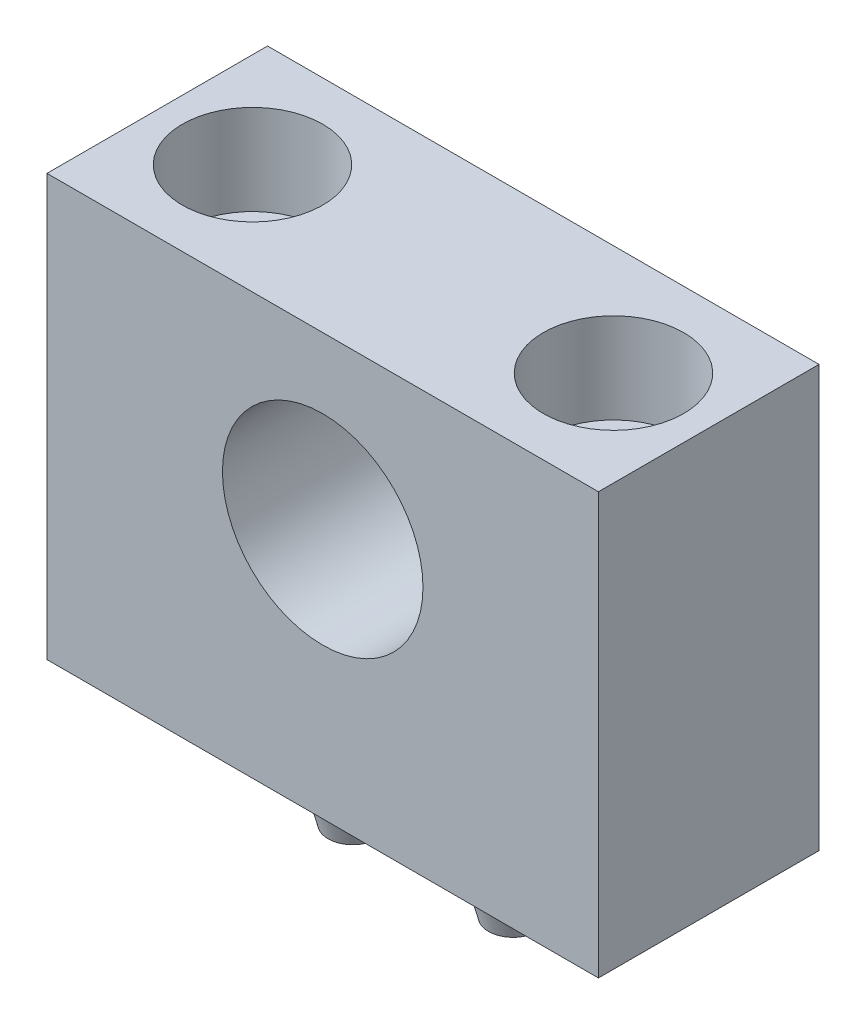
ISO-10303-21;
HEADER;
FILE_DESCRIPTION(('STEP AP214'),'2;1');
FILE_NAME('part.step','',(''),(''),'','','');
FILE_SCHEMA(('AUTOMOTIVE_DESIGN { 1 0 10303 214 1 1 1 1 }'));
ENDSEC;
DATA;
#1=APPLICATION_CONTEXT('core data for automotive mechanical design processes');
#2=APPLICATION_PROTOCOL_DEFINITION('international standard','automotive_design',2000,#1);
#3=PRODUCT_CONTEXT('',#1,'mechanical');
#4=PRODUCT('Part','Part','',(#3));
#5=PRODUCT_RELATED_PRODUCT_CATEGORY('part','',(#4));
#6=PRODUCT_DEFINITION_FORMATION('','',#4);
#7=PRODUCT_DEFINITION_CONTEXT('part definition',#1,'design');
#8=PRODUCT_DEFINITION('design','',#6,#7);
#9=PRODUCT_DEFINITION_SHAPE('','',#8);
#10=(LENGTH_UNIT() NAMED_UNIT(*) SI_UNIT(.MILLI.,.METRE.));
#11=(NAMED_UNIT(*) PLANE_ANGLE_UNIT() SI_UNIT($,.RADIAN.));
#12=(NAMED_UNIT(*) SI_UNIT($,.STERADIAN.) SOLID_ANGLE_UNIT());
#13=UNCERTAINTY_MEASURE_WITH_UNIT(LENGTH_MEASURE(1.E-05),#10,'distance_accuracy_value','');
#14=(GEOMETRIC_REPRESENTATION_CONTEXT(3) GLOBAL_UNCERTAINTY_ASSIGNED_CONTEXT((#13)) GLOBAL_UNIT_ASSIGNED_CONTEXT((#10,
#11,#12)) REPRESENTATION_CONTEXT('',''));
#15=CARTESIAN_POINT('',(0.,0.,0.));
#16=DIRECTION('',(0.,0.,1.));
#17=DIRECTION('',(1.,0.,0.));
#18=AXIS2_PLACEMENT_3D('',#15,#16,#17);
#19=CARTESIAN_POINT('',(18.,42.,0.));
#20=DIRECTION('',(0.,-1.,0.));
#21=DIRECTION('',(0.,0.,1.));
#22=AXIS2_PLACEMENT_3D('',#19,#20,#21);
#23=CYLINDRICAL_SURFACE('',#22,4.5);
#24=CARTESIAN_POINT('',(18.,0.,0.));
#25=DIRECTION('',(0.,1.,0.));
#26=DIRECTION('',(0.,0.,-1.));
#27=AXIS2_PLACEMENT_3D('',#24,#25,#26);
#28=CIRCLE('',#27,4.5);
#29=CARTESIAN_POINT('',(18.,0.,-4.5));
#30=VERTEX_POINT('',#29);
#31=EDGE_CURVE('E121',#30,#30,#28,.T.);
#32=ORIENTED_EDGE('',*,*,#31,.F.);
#33=EDGE_LOOP('',(#32));
#34=FACE_BOUND('',#33,.T.);
#35=CARTESIAN_POINT('',(18.,33.,0.));
#36=DIRECTION('',(0.,1.,0.));
#37=DIRECTION('',(0.,0.,-1.));
#38=AXIS2_PLACEMENT_3D('',#35,#36,#37);
#39=CIRCLE('',#38,4.5);
#40=CARTESIAN_POINT('',(18.,33.,-4.5));
#41=VERTEX_POINT('',#40);
#42=EDGE_CURVE('E102',#41,#41,#39,.T.);
#43=ORIENTED_EDGE('',*,*,#42,.T.);
#44=EDGE_LOOP('',(#43));
#45=FACE_BOUND('',#44,.T.);
#46=ADVANCED_FACE('F16',(#34,#45),#23,.F.);
#47=CARTESIAN_POINT('',(-18.,42.,0.));
#48=DIRECTION('',(0.,-1.,0.));
#49=DIRECTION('',(0.,0.,1.));
#50=AXIS2_PLACEMENT_3D('',#47,#48,#49);
#51=CYLINDRICAL_SURFACE('',#50,4.5);
#52=CARTESIAN_POINT('',(-18.,0.,0.));
#53=DIRECTION('',(0.,1.,0.));
#54=DIRECTION('',(0.,0.,-1.));
#55=AXIS2_PLACEMENT_3D('',#52,#53,#54);
#56=CIRCLE('',#55,4.5);
#57=CARTESIAN_POINT('',(-18.,0.,-4.5));
#58=VERTEX_POINT('',#57);
#59=EDGE_CURVE('E115',#58,#58,#56,.T.);
#60=ORIENTED_EDGE('',*,*,#59,.F.);
#61=EDGE_LOOP('',(#60));
#62=FACE_BOUND('',#61,.T.);
#63=CARTESIAN_POINT('',(-18.,33.,0.));
#64=DIRECTION('',(0.,1.,0.));
#65=DIRECTION('',(0.,0.,-1.));
#66=AXIS2_PLACEMENT_3D('',#63,#64,#65);
#67=CIRCLE('',#66,4.5);
#68=CARTESIAN_POINT('',(-18.,33.,-4.5));
#69=VERTEX_POINT('',#68);
#70=EDGE_CURVE('E108',#69,#69,#67,.T.);
#71=ORIENTED_EDGE('',*,*,#70,.T.);
#72=EDGE_LOOP('',(#71));
#73=FACE_BOUND('',#72,.T.);
#74=ADVANCED_FACE('F198',(#62,#73),#51,.F.);
#75=CARTESIAN_POINT('',(0.,42.,0.));
#76=DIRECTION('',(0.,-1.,0.));
#77=DIRECTION('',(0.,0.,1.));
#78=AXIS2_PLACEMENT_3D('',#75,#76,#77);
#79=PLANE('',#78);
#80=CARTESIAN_POINT('',(18.,42.,0.));
#81=DIRECTION('',(0.,1.,0.));
#82=DIRECTION('',(0.,0.,-1.));
#83=AXIS2_PLACEMENT_3D('',#80,#81,#82);
#84=CIRCLE('',#83,7.);
#85=CARTESIAN_POINT('',(18.,42.,-7.));
#86=VERTEX_POINT('',#85);
#87=EDGE_CURVE('E98',#86,#86,#84,.T.);
#88=ORIENTED_EDGE('',*,*,#87,.F.);
#89=EDGE_LOOP('',(#88));
#90=FACE_BOUND('',#89,.T.);
#91=CARTESIAN_POINT('',(-18.,42.,0.));
#92=DIRECTION('',(0.,1.,0.));
#93=DIRECTION('',(0.,0.,-1.));
#94=AXIS2_PLACEMENT_3D('',#91,#92,#93);
#95=CIRCLE('',#94,7.);
#96=CARTESIAN_POINT('',(-18.,42.,-7.));
#97=VERTEX_POINT('',#96);
#98=EDGE_CURVE('E109',#97,#97,#95,.T.);
#99=ORIENTED_EDGE('',*,*,#98,.F.);
#100=EDGE_LOOP('',(#99));
#101=FACE_BOUND('',#100,.T.);
#102=DIRECTION('',(0.,0.,1.));
#103=VECTOR('',#102,1.);
#104=CARTESIAN_POINT('',(-27.5,42.,-11.));
#105=LINE('',#104,#103);
#106=CARTESIAN_POINT('',(-27.5,42.,-11.));
#107=VERTEX_POINT('',#106);
#108=CARTESIAN_POINT('',(-27.5,42.,11.));
#109=VERTEX_POINT('',#108);
#110=EDGE_CURVE('E125',#107,#109,#105,.T.);
#111=ORIENTED_EDGE('',*,*,#110,.T.);
#112=DIRECTION('',(1.,0.,0.));
#113=VECTOR('',#112,1.);
#114=CARTESIAN_POINT('',(27.5,42.,11.));
#115=LINE('',#114,#113);
#116=CARTESIAN_POINT('',(27.5,42.,11.));
#117=VERTEX_POINT('',#116);
#118=EDGE_CURVE('E66',#109,#117,#115,.T.);
#119=ORIENTED_EDGE('',*,*,#118,.T.);
#120=DIRECTION('',(0.,0.,-1.));
#121=VECTOR('',#120,1.);
#122=CARTESIAN_POINT('',(27.5,42.,-11.));
#123=LINE('',#122,#121);
#124=CARTESIAN_POINT('',(27.5,42.,-11.));
#125=VERTEX_POINT('',#124);
#126=EDGE_CURVE('E128',#117,#125,#123,.T.);
#127=ORIENTED_EDGE('',*,*,#126,.T.);
#128=DIRECTION('',(-1.,0.,0.));
#129=VECTOR('',#128,1.);
#130=CARTESIAN_POINT('',(27.5,42.,-11.));
#131=LINE('',#130,#129);
#132=EDGE_CURVE('E34',#125,#107,#131,.T.);
#133=ORIENTED_EDGE('',*,*,#132,.T.);
#134=EDGE_LOOP('',(#111,#119,#127,#133));
#135=FACE_BOUND('',#134,.T.);
#136=ADVANCED_FACE('F204',(#90,#101,#135),#79,.F.);
#137=CARTESIAN_POINT('',(0.,0.,0.));
#138=DIRECTION('',(0.,-1.,0.));
#139=DIRECTION('',(0.,0.,1.));
#140=AXIS2_PLACEMENT_3D('',#137,#138,#139);
#141=PLANE('',#140);
#142=CARTESIAN_POINT('',(8.,0.,0.));
#143=DIRECTION('',(0.,-1.,0.));
#144=DIRECTION('',(0.,0.,1.));
#145=AXIS2_PLACEMENT_3D('',#142,#143,#144);
#146=CIRCLE('',#145,3.);
#147=CARTESIAN_POINT('',(8.,0.,3.));
#148=VERTEX_POINT('',#147);
#149=EDGE_CURVE('E86',#148,#148,#146,.T.);
#150=ORIENTED_EDGE('',*,*,#149,.F.);
#151=EDGE_LOOP('',(#150));
#152=FACE_BOUND('',#151,.T.);
#153=CARTESIAN_POINT('',(-8.,0.,0.));
#154=DIRECTION('',(0.,-1.,0.));
#155=DIRECTION('',(0.,0.,1.));
#156=AXIS2_PLACEMENT_3D('',#153,#154,#155);
#157=CIRCLE('',#156,3.);
#158=CARTESIAN_POINT('',(-8.,0.,3.));
#159=VERTEX_POINT('',#158);
#160=EDGE_CURVE('E85',#159,#159,#157,.T.);
#161=ORIENTED_EDGE('',*,*,#160,.F.);
#162=EDGE_LOOP('',(#161));
#163=FACE_BOUND('',#162,.T.);
#164=ORIENTED_EDGE('',*,*,#31,.T.);
#165=EDGE_LOOP('',(#164));
#166=FACE_BOUND('',#165,.T.);
#167=DIRECTION('',(0.,0.,1.));
#168=VECTOR('',#167,1.);
#169=CARTESIAN_POINT('',(-27.5,0.,-11.));
#170=LINE('',#169,#168);
#171=CARTESIAN_POINT('',(-27.5,0.,-11.));
#172=VERTEX_POINT('',#171);
#173=CARTESIAN_POINT('',(-27.5,0.,11.));
#174=VERTEX_POINT('',#173);
#175=EDGE_CURVE('E124',#172,#174,#170,.T.);
#176=ORIENTED_EDGE('',*,*,#175,.F.);
#177=DIRECTION('',(-1.,0.,0.));
#178=VECTOR('',#177,1.);
#179=CARTESIAN_POINT('',(27.5,0.,-11.));
#180=LINE('',#179,#178);
#181=CARTESIAN_POINT('',(27.5,0.,-11.));
#182=VERTEX_POINT('',#181);
#183=EDGE_CURVE('E58',#182,#172,#180,.T.);
#184=ORIENTED_EDGE('',*,*,#183,.F.);
#185=DIRECTION('',(0.,0.,-1.));
#186=VECTOR('',#185,1.);
#187=CARTESIAN_POINT('',(27.5,0.,-11.));
#188=LINE('',#187,#186);
#189=CARTESIAN_POINT('',(27.5,0.,11.));
#190=VERTEX_POINT('',#189);
#191=EDGE_CURVE('E52',#190,#182,#188,.T.);
#192=ORIENTED_EDGE('',*,*,#191,.F.);
#193=DIRECTION('',(1.,0.,0.));
#194=VECTOR('',#193,1.);
#195=CARTESIAN_POINT('',(27.5,0.,11.));
#196=LINE('',#195,#194);
#197=EDGE_CURVE('E134',#174,#190,#196,.T.);
#198=ORIENTED_EDGE('',*,*,#197,.F.);
#199=EDGE_LOOP('',(#176,#184,#192,#198));
#200=FACE_BOUND('',#199,.T.);
#201=ORIENTED_EDGE('',*,*,#59,.T.);
#202=EDGE_LOOP('',(#201));
#203=FACE_BOUND('',#202,.T.);
#204=ADVANCED_FACE('F213',(#152,#163,#166,#200,#203),#141,.T.);
#205=CARTESIAN_POINT('',(-27.5,42.,-11.));
#206=DIRECTION('',(1.,0.,0.));
#207=DIRECTION('',(0.,0.,-1.));
#208=AXIS2_PLACEMENT_3D('',#205,#206,#207);
#209=PLANE('',#208);
#210=ORIENTED_EDGE('',*,*,#175,.T.);
#211=DIRECTION('',(0.,-1.,0.));
#212=VECTOR('',#211,1.);
#213=CARTESIAN_POINT('',(-27.5,42.,11.));
#214=LINE('',#213,#212);
#215=EDGE_CURVE('E143',#109,#174,#214,.T.);
#216=ORIENTED_EDGE('',*,*,#215,.F.);
#217=ORIENTED_EDGE('',*,*,#110,.F.);
#218=DIRECTION('',(0.,-1.,0.));
#219=VECTOR('',#218,1.);
#220=CARTESIAN_POINT('',(-27.5,42.,-11.));
#221=LINE('',#220,#219);
#222=EDGE_CURVE('E131',#107,#172,#221,.T.);
#223=ORIENTED_EDGE('',*,*,#222,.T.);
#224=EDGE_LOOP('',(#210,#216,#217,#223));
#225=FACE_BOUND('',#224,.T.);
#226=ADVANCED_FACE('F18',(#225),#209,.F.);
#227=CARTESIAN_POINT('',(27.5,42.,11.));
#228=DIRECTION('',(0.,0.,-1.));
#229=DIRECTION('',(-1.,0.,0.));
#230=AXIS2_PLACEMENT_3D('',#227,#228,#229);
#231=PLANE('',#230);
#232=CARTESIAN_POINT('',(0.,25.,11.));
#233=DIRECTION('',(0.,0.,-1.));
#234=DIRECTION('',(-1.,0.,0.));
#235=AXIS2_PLACEMENT_3D('',#232,#233,#234);
#236=CIRCLE('',#235,10.);
#237=CARTESIAN_POINT('',(-10.,25.,11.));
#238=VERTEX_POINT('',#237);
#239=EDGE_CURVE('E112',#238,#238,#236,.T.);
#240=ORIENTED_EDGE('',*,*,#239,.T.);
#241=EDGE_LOOP('',(#240));
#242=FACE_BOUND('',#241,.T.);
#243=ORIENTED_EDGE('',*,*,#197,.T.);
#244=DIRECTION('',(0.,-1.,0.));
#245=VECTOR('',#244,1.);
#246=CARTESIAN_POINT('',(27.5,42.,11.));
#247=LINE('',#246,#245);
#248=EDGE_CURVE('E141',#117,#190,#247,.T.);
#249=ORIENTED_EDGE('',*,*,#248,.F.);
#250=ORIENTED_EDGE('',*,*,#118,.F.);
#251=ORIENTED_EDGE('',*,*,#215,.T.);
#252=EDGE_LOOP('',(#243,#249,#250,#251));
#253=FACE_BOUND('',#252,.T.);
#254=ADVANCED_FACE('F225',(#242,#253),#231,.F.);
#255=CARTESIAN_POINT('',(27.5,42.,-11.));
#256=DIRECTION('',(-1.,0.,0.));
#257=DIRECTION('',(0.,0.,1.));
#258=AXIS2_PLACEMENT_3D('',#255,#256,#257);
#259=PLANE('',#258);
#260=ORIENTED_EDGE('',*,*,#191,.T.);
#261=DIRECTION('',(0.,-1.,0.));
#262=VECTOR('',#261,1.);
#263=CARTESIAN_POINT('',(27.5,42.,-11.));
#264=LINE('',#263,#262);
#265=EDGE_CURVE('E139',#125,#182,#264,.T.);
#266=ORIENTED_EDGE('',*,*,#265,.F.);
#267=ORIENTED_EDGE('',*,*,#126,.F.);
#268=ORIENTED_EDGE('',*,*,#248,.T.);
#269=EDGE_LOOP('',(#260,#266,#267,#268));
#270=FACE_BOUND('',#269,.T.);
#271=ADVANCED_FACE('F222',(#270),#259,.F.);
#272=CARTESIAN_POINT('',(27.5,42.,-11.));
#273=DIRECTION('',(0.,0.,1.));
#274=DIRECTION('',(1.,0.,0.));
#275=AXIS2_PLACEMENT_3D('',#272,#273,#274);
#276=PLANE('',#275);
#277=CARTESIAN_POINT('',(0.,25.,-11.));
#278=DIRECTION('',(0.,0.,-1.));
#279=DIRECTION('',(-1.,0.,0.));
#280=AXIS2_PLACEMENT_3D('',#277,#278,#279);
#281=CIRCLE('',#280,10.);
#282=CARTESIAN_POINT('',(-10.,25.,-11.));
#283=VERTEX_POINT('',#282);
#284=EDGE_CURVE('E116',#283,#283,#281,.T.);
#285=ORIENTED_EDGE('',*,*,#284,.F.);
#286=EDGE_LOOP('',(#285));
#287=FACE_BOUND('',#286,.T.);
#288=ORIENTED_EDGE('',*,*,#183,.T.);
#289=ORIENTED_EDGE('',*,*,#222,.F.);
#290=ORIENTED_EDGE('',*,*,#132,.F.);
#291=ORIENTED_EDGE('',*,*,#265,.T.);
#292=EDGE_LOOP('',(#288,#289,#290,#291));
#293=FACE_BOUND('',#292,.T.);
#294=ADVANCED_FACE('F218',(#287,#293),#276,.F.);
#295=CARTESIAN_POINT('',(0.,25.,11.));
#296=DIRECTION('',(0.,0.,-1.));
#297=DIRECTION('',(-1.,0.,0.));
#298=AXIS2_PLACEMENT_3D('',#295,#296,#297);
#299=CYLINDRICAL_SURFACE('',#298,10.);
#300=ORIENTED_EDGE('',*,*,#239,.F.);
#301=EDGE_LOOP('',(#300));
#302=FACE_BOUND('',#301,.T.);
#303=ORIENTED_EDGE('',*,*,#284,.T.);
#304=EDGE_LOOP('',(#303));
#305=FACE_BOUND('',#304,.T.);
#306=ADVANCED_FACE('F221',(#302,#305),#299,.F.);
#307=CARTESIAN_POINT('',(-18.,33.,0.));
#308=DIRECTION('',(0.,1.,0.));
#309=DIRECTION('',(0.,0.,-1.));
#310=AXIS2_PLACEMENT_3D('',#307,#308,#309);
#311=CYLINDRICAL_SURFACE('',#310,7.);
#312=CARTESIAN_POINT('',(-18.,33.,0.));
#313=DIRECTION('',(0.,1.,0.));
#314=DIRECTION('',(0.,0.,-1.));
#315=AXIS2_PLACEMENT_3D('',#312,#313,#314);
#316=CIRCLE('',#315,7.);
#317=CARTESIAN_POINT('',(-18.,33.,-7.));
#318=VERTEX_POINT('',#317);
#319=EDGE_CURVE('E105',#318,#318,#316,.T.);
#320=ORIENTED_EDGE('',*,*,#319,.F.);
#321=EDGE_LOOP('',(#320));
#322=FACE_BOUND('',#321,.T.);
#323=ORIENTED_EDGE('',*,*,#98,.T.);
#324=EDGE_LOOP('',(#323));
#325=FACE_BOUND('',#324,.T.);
#326=ADVANCED_FACE('F247',(#322,#325),#311,.F.);
#327=CARTESIAN_POINT('',(-18.,33.,0.));
#328=DIRECTION('',(0.,1.,0.));
#329=DIRECTION('',(0.,0.,-1.));
#330=AXIS2_PLACEMENT_3D('',#327,#328,#329);
#331=PLANE('',#330);
#332=ORIENTED_EDGE('',*,*,#70,.F.);
#333=EDGE_LOOP('',(#332));
#334=FACE_BOUND('',#333,.T.);
#335=ORIENTED_EDGE('',*,*,#319,.T.);
#336=EDGE_LOOP('',(#335));
#337=FACE_BOUND('',#336,.T.);
#338=ADVANCED_FACE('F243',(#334,#337),#331,.T.);
#339=CARTESIAN_POINT('',(18.,33.,0.));
#340=DIRECTION('',(0.,1.,0.));
#341=DIRECTION('',(0.,0.,-1.));
#342=AXIS2_PLACEMENT_3D('',#339,#340,#341);
#343=CYLINDRICAL_SURFACE('',#342,7.);
#344=CARTESIAN_POINT('',(18.,33.,0.));
#345=DIRECTION('',(0.,1.,0.));
#346=DIRECTION('',(0.,0.,-1.));
#347=AXIS2_PLACEMENT_3D('',#344,#345,#346);
#348=CIRCLE('',#347,7.);
#349=CARTESIAN_POINT('',(18.,33.,-7.));
#350=VERTEX_POINT('',#349);
#351=EDGE_CURVE('E99',#350,#350,#348,.T.);
#352=ORIENTED_EDGE('',*,*,#351,.F.);
#353=EDGE_LOOP('',(#352));
#354=FACE_BOUND('',#353,.T.);
#355=ORIENTED_EDGE('',*,*,#87,.T.);
#356=EDGE_LOOP('',(#355));
#357=FACE_BOUND('',#356,.T.);
#358=ADVANCED_FACE('F246',(#354,#357),#343,.F.);
#359=CARTESIAN_POINT('',(18.,33.,0.));
#360=DIRECTION('',(0.,1.,0.));
#361=DIRECTION('',(0.,0.,-1.));
#362=AXIS2_PLACEMENT_3D('',#359,#360,#361);
#363=PLANE('',#362);
#364=ORIENTED_EDGE('',*,*,#42,.F.);
#365=EDGE_LOOP('',(#364));
#366=FACE_BOUND('',#365,.T.);
#367=ORIENTED_EDGE('',*,*,#351,.T.);
#368=EDGE_LOOP('',(#367));
#369=FACE_BOUND('',#368,.T.);
#370=ADVANCED_FACE('F168',(#366,#369),#363,.T.);
#371=CARTESIAN_POINT('',(8.,20.,0.));
#372=DIRECTION('',(0.,1.,0.));
#373=DIRECTION('',(0.,0.,1.));
#374=AXIS2_PLACEMENT_3D('',#371,#372,#373);
#375=CYLINDRICAL_SURFACE('',#374,3.);
#376=ORIENTED_EDGE('',*,*,#149,.T.);
#377=EDGE_LOOP('',(#376));
#378=FACE_BOUND('',#377,.T.);
#379=CARTESIAN_POINT('',(8.,-8.,0.));
#380=DIRECTION('',(0.,1.,0.));
#381=DIRECTION('',(0.,0.,1.));
#382=AXIS2_PLACEMENT_3D('',#379,#380,#381);
#383=CIRCLE('',#382,3.);
#384=CARTESIAN_POINT('',(8.,-8.,3.));
#385=VERTEX_POINT('',#384);
#386=EDGE_CURVE('E92',#385,#385,#383,.T.);
#387=ORIENTED_EDGE('',*,*,#386,.T.);
#388=EDGE_LOOP('',(#387));
#389=FACE_BOUND('',#388,.T.);
#390=ADVANCED_FACE('F164',(#378,#389),#375,.T.);
#391=CARTESIAN_POINT('',(8.,-10.,0.));
#392=DIRECTION('',(0.,1.,0.));
#393=DIRECTION('',(0.,0.,1.));
#394=AXIS2_PLACEMENT_3D('',#391,#392,#393);
#395=CONICAL_SURFACE('',#394,2.46410161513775,0.26179938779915);
#396=ORIENTED_EDGE('',*,*,#386,.F.);
#397=EDGE_LOOP('',(#396));
#398=FACE_BOUND('',#397,.T.);
#399=CARTESIAN_POINT('',(8.,-10.,0.));
#400=DIRECTION('',(0.,1.,0.));
#401=DIRECTION('',(0.,0.,1.));
#402=AXIS2_PLACEMENT_3D('',#399,#400,#401);
#403=CIRCLE('',#402,2.46410161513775);
#404=CARTESIAN_POINT('',(8.,-10.,2.46410161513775));
#405=VERTEX_POINT('',#404);
#406=EDGE_CURVE('E542',#405,#405,#403,.T.);
#407=ORIENTED_EDGE('',*,*,#406,.T.);
#408=EDGE_LOOP('',(#407));
#409=FACE_BOUND('',#408,.T.);
#410=ADVANCED_FACE('F167',(#398,#409),#395,.T.);
#411=CARTESIAN_POINT('',(8.,-10.,0.));
#412=DIRECTION('',(0.,1.,0.));
#413=DIRECTION('',(0.,0.,1.));
#414=AXIS2_PLACEMENT_3D('',#411,#412,#413);
#415=PLANE('',#414);
#416=ORIENTED_EDGE('',*,*,#406,.F.);
#417=EDGE_LOOP('',(#416));
#418=FACE_BOUND('',#417,.T.);
#419=ADVANCED_FACE('F172',(#418),#415,.F.);
#420=CARTESIAN_POINT('',(-8.,20.,0.));
#421=DIRECTION('',(0.,1.,0.));
#422=DIRECTION('',(0.,0.,1.));
#423=AXIS2_PLACEMENT_3D('',#420,#421,#422);
#424=CYLINDRICAL_SURFACE('',#423,3.);
#425=ORIENTED_EDGE('',*,*,#160,.T.);
#426=EDGE_LOOP('',(#425));
#427=FACE_BOUND('',#426,.T.);
#428=CARTESIAN_POINT('',(-8.,-8.,0.));
#429=DIRECTION('',(0.,1.,0.));
#430=DIRECTION('',(0.,0.,1.));
#431=AXIS2_PLACEMENT_3D('',#428,#429,#430);
#432=CIRCLE('',#431,3.);
#433=CARTESIAN_POINT('',(-8.,-8.,3.));
#434=VERTEX_POINT('',#433);
#435=EDGE_CURVE('E541',#434,#434,#432,.T.);
#436=ORIENTED_EDGE('',*,*,#435,.T.);
#437=EDGE_LOOP('',(#436));
#438=FACE_BOUND('',#437,.T.);
#439=ADVANCED_FACE('F176',(#427,#438),#424,.T.);
#440=CARTESIAN_POINT('',(-8.,-10.,0.));
#441=DIRECTION('',(0.,1.,0.));
#442=DIRECTION('',(0.,0.,1.));
#443=AXIS2_PLACEMENT_3D('',#440,#441,#442);
#444=CONICAL_SURFACE('',#443,2.46410161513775,0.26179938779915);
#445=ORIENTED_EDGE('',*,*,#435,.F.);
#446=EDGE_LOOP('',(#445));
#447=FACE_BOUND('',#446,.T.);
#448=CARTESIAN_POINT('',(-8.,-10.,0.));
#449=DIRECTION('',(0.,1.,0.));
#450=DIRECTION('',(0.,0.,1.));
#451=AXIS2_PLACEMENT_3D('',#448,#449,#450);
#452=CIRCLE('',#451,2.46410161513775);
#453=CARTESIAN_POINT('',(-8.,-10.,2.46410161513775));
#454=VERTEX_POINT('',#453);
#455=EDGE_CURVE('E543',#454,#454,#452,.T.);
#456=ORIENTED_EDGE('',*,*,#455,.T.);
#457=EDGE_LOOP('',(#456));
#458=FACE_BOUND('',#457,.T.);
#459=ADVANCED_FACE('F186',(#447,#458),#444,.T.);
#460=CARTESIAN_POINT('',(-8.,-10.,0.));
#461=DIRECTION('',(0.,1.,0.));
#462=DIRECTION('',(0.,0.,1.));
#463=AXIS2_PLACEMENT_3D('',#460,#461,#462);
#464=PLANE('',#463);
#465=ORIENTED_EDGE('',*,*,#455,.F.);
#466=EDGE_LOOP('',(#465));
#467=FACE_BOUND('',#466,.T.);
#468=ADVANCED_FACE('F190',(#467),#464,.F.);
#469=CLOSED_SHELL('',(#46,#74,#136,#204,#226,#254,#271,#294,#306,#326,#338,#358,#370,#390,#410,
#419,#439,#459,#468));
#470=CARTESIAN_POINT('',(-8.,4.,0.));
#471=DIRECTION('',(0.,1.,0.));
#472=DIRECTION('',(0.,0.,-1.));
#473=AXIS2_PLACEMENT_3D('',#470,#471,#472);
#474=SPHERICAL_SURFACE('',#473,6.);
#475=CARTESIAN_POINT('',(-8.,9.19615242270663,0.));
#476=DIRECTION('',(0.,-1.,0.));
#477=DIRECTION('',(-1.,0.,0.));
#478=AXIS2_PLACEMENT_3D('',#475,#476,#477);
#479=CIRCLE('',#478,3.);
#480=CARTESIAN_POINT('',(-11.,9.19615242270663,0.));
#481=VERTEX_POINT('',#480);
#482=EDGE_CURVE('E10',#481,#481,#479,.F.);
#483=ORIENTED_EDGE('',*,*,#482,.T.);
#484=EDGE_LOOP('',(#483));
#485=FACE_BOUND('',#484,.T.);
#486=ADVANCED_FACE('F178',(#485),#474,.T.);
#487=CARTESIAN_POINT('',(-8.,12.,0.));
#488=DIRECTION('',(0.,-1.,0.));
#489=DIRECTION('',(0.,0.,1.));
#490=AXIS2_PLACEMENT_3D('',#487,#488,#489);
#491=CONICAL_SURFACE('',#490,3.,1.02974425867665);
#492=CARTESIAN_POINT('',(-8.,13.8025818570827,0.));
#493=VERTEX_POINT('',#492);
#494=VERTEX_LOOP('',#493);
#495=FACE_BOUND('',#494,.T.);
#496=CARTESIAN_POINT('',(-8.,12.,0.));
#497=DIRECTION('',(0.,-1.,0.));
#498=DIRECTION('',(0.,0.,1.));
#499=AXIS2_PLACEMENT_3D('',#496,#497,#498);
#500=CIRCLE('',#499,3.);
#501=CARTESIAN_POINT('',(-8.,12.,3.));
#502=VERTEX_POINT('',#501);
#503=EDGE_CURVE('E89',#502,#502,#500,.T.);
#504=ORIENTED_EDGE('',*,*,#503,.T.);
#505=EDGE_LOOP('',(#504));
#506=FACE_BOUND('',#505,.T.);
#507=ADVANCED_FACE('F181',(#495,#506),#491,.F.);
#508=CARTESIAN_POINT('',(-8.,0.,0.));
#509=DIRECTION('',(0.,-1.,0.));
#510=DIRECTION('',(0.,0.,1.));
#511=AXIS2_PLACEMENT_3D('',#508,#509,#510);
#512=CYLINDRICAL_SURFACE('',#511,3.);
#513=ORIENTED_EDGE('',*,*,#503,.F.);
#514=EDGE_LOOP('',(#513));
#515=FACE_BOUND('',#514,.T.);
#516=ORIENTED_EDGE('',*,*,#482,.F.);
#517=EDGE_LOOP('',(#516));
#518=FACE_BOUND('',#517,.T.);
#519=ADVANCED_FACE('F269',(#515,#518),#512,.F.);
#520=CLOSED_SHELL('',(#486,#507,#519));
#521=CARTESIAN_POINT('',(8.,4.,0.));
#522=DIRECTION('',(0.,1.,0.));
#523=DIRECTION('',(0.,0.,-1.));
#524=AXIS2_PLACEMENT_3D('',#521,#522,#523);
#525=SPHERICAL_SURFACE('',#524,6.);
#526=CARTESIAN_POINT('',(8.,9.19615242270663,0.));
#527=DIRECTION('',(0.,-1.,0.));
#528=DIRECTION('',(-1.,0.,0.));
#529=AXIS2_PLACEMENT_3D('',#526,#527,#528);
#530=CIRCLE('',#529,3.);
#531=CARTESIAN_POINT('',(5.,9.19615242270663,0.));
#532=VERTEX_POINT('',#531);
#533=EDGE_CURVE('E26',#532,#532,#530,.F.);
#534=ORIENTED_EDGE('',*,*,#533,.T.);
#535=EDGE_LOOP('',(#534));
#536=FACE_BOUND('',#535,.T.);
#537=ADVANCED_FACE('F77',(#536),#525,.T.);
#538=CARTESIAN_POINT('',(8.,12.,0.));
#539=DIRECTION('',(0.,-1.,0.));
#540=DIRECTION('',(0.,0.,1.));
#541=AXIS2_PLACEMENT_3D('',#538,#539,#540);
#542=CONICAL_SURFACE('',#541,3.,1.02974425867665);
#543=CARTESIAN_POINT('',(8.,13.8025818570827,0.));
#544=VERTEX_POINT('',#543);
#545=VERTEX_LOOP('',#544);
#546=FACE_BOUND('',#545,.T.);
#547=CARTESIAN_POINT('',(8.,12.,0.));
#548=DIRECTION('',(0.,-1.,0.));
#549=DIRECTION('',(0.,0.,1.));
#550=AXIS2_PLACEMENT_3D('',#547,#548,#549);
#551=CIRCLE('',#550,3.);
#552=CARTESIAN_POINT('',(8.,12.,3.));
#553=VERTEX_POINT('',#552);
#554=EDGE_CURVE('E83',#553,#553,#551,.T.);
#555=ORIENTED_EDGE('',*,*,#554,.T.);
#556=EDGE_LOOP('',(#555));
#557=FACE_BOUND('',#556,.T.);
#558=ADVANCED_FACE('F73',(#546,#557),#542,.F.);
#559=CARTESIAN_POINT('',(8.,0.,0.));
#560=DIRECTION('',(0.,-1.,0.));
#561=DIRECTION('',(0.,0.,1.));
#562=AXIS2_PLACEMENT_3D('',#559,#560,#561);
#563=CYLINDRICAL_SURFACE('',#562,3.);
#564=ORIENTED_EDGE('',*,*,#554,.F.);
#565=EDGE_LOOP('',(#564));
#566=FACE_BOUND('',#565,.T.);
#567=ORIENTED_EDGE('',*,*,#533,.F.);
#568=EDGE_LOOP('',(#567));
#569=FACE_BOUND('',#568,.T.);
#570=ADVANCED_FACE('F76',(#566,#569),#563,.F.);
#571=CLOSED_SHELL('',(#537,#558,#570));
#572=ORIENTED_CLOSED_SHELL('',*,#520,.T.);
#573=ORIENTED_CLOSED_SHELL('',*,#571,.T.);
#574=BREP_WITH_VOIDS('B1',#469,(#572,#573));
#575=ADVANCED_BREP_SHAPE_REPRESENTATION('',(#18,#574),#14);
#576=SHAPE_DEFINITION_REPRESENTATION(#9,#575);
ENDSEC;
END-ISO-10303-21;
